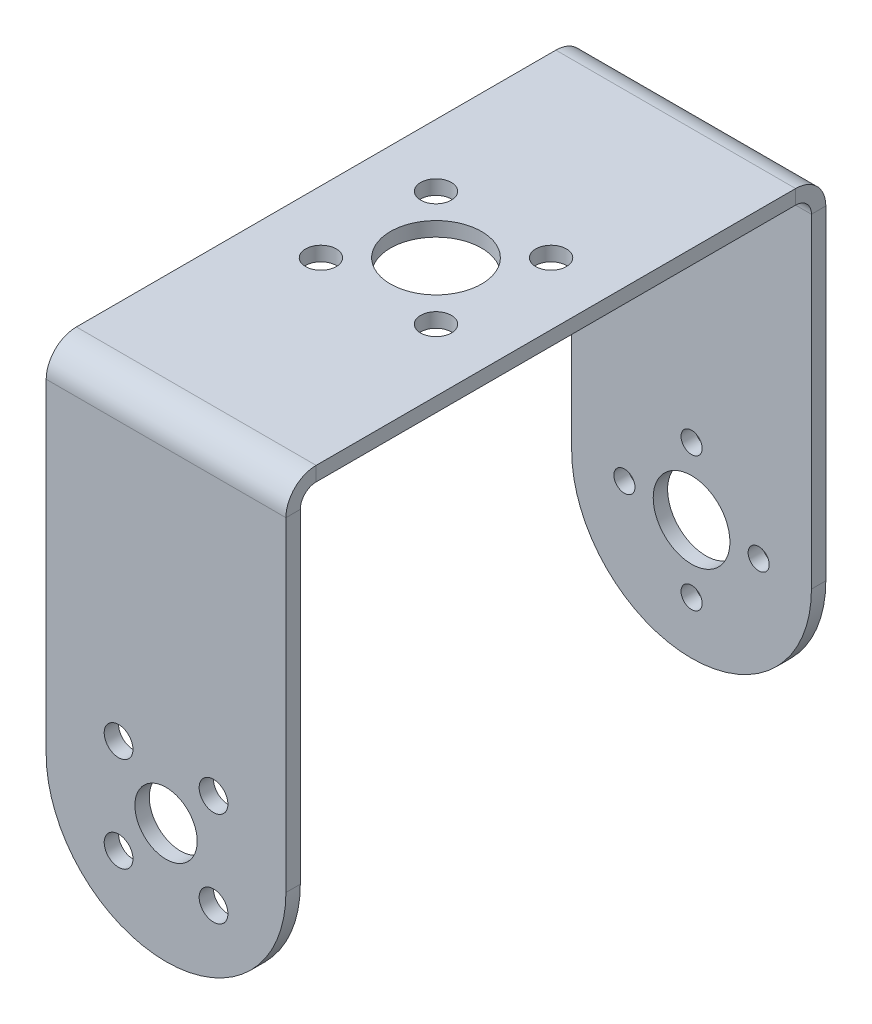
ISO-10303-21;
HEADER;
FILE_DESCRIPTION(('STEP AP214'),'2;1');
FILE_NAME('part.step','',(''),(''),'','','');
FILE_SCHEMA(('AUTOMOTIVE_DESIGN { 1 0 10303 214 1 1 1 1 }'));
ENDSEC;
DATA;
#1=APPLICATION_CONTEXT('core data for automotive mechanical design processes');
#2=APPLICATION_PROTOCOL_DEFINITION('international standard','automotive_design',2000,#1);
#3=PRODUCT_CONTEXT('',#1,'mechanical');
#4=PRODUCT('Part','Part','',(#3));
#5=PRODUCT_RELATED_PRODUCT_CATEGORY('part','',(#4));
#6=PRODUCT_DEFINITION_FORMATION('','',#4);
#7=PRODUCT_DEFINITION_CONTEXT('part definition',#1,'design');
#8=PRODUCT_DEFINITION('design','',#6,#7);
#9=PRODUCT_DEFINITION_SHAPE('','',#8);
#10=(LENGTH_UNIT() NAMED_UNIT(*) SI_UNIT(.MILLI.,.METRE.));
#11=(NAMED_UNIT(*) PLANE_ANGLE_UNIT() SI_UNIT($,.RADIAN.));
#12=(NAMED_UNIT(*) SI_UNIT($,.STERADIAN.) SOLID_ANGLE_UNIT());
#13=UNCERTAINTY_MEASURE_WITH_UNIT(LENGTH_MEASURE(1.E-05),#10,'distance_accuracy_value','');
#14=(GEOMETRIC_REPRESENTATION_CONTEXT(3) GLOBAL_UNCERTAINTY_ASSIGNED_CONTEXT((#13)) GLOBAL_UNIT_ASSIGNED_CONTEXT((#10,
#11,#12)) REPRESENTATION_CONTEXT('',''));
#15=CARTESIAN_POINT('',(0.,0.,0.));
#16=DIRECTION('',(0.,0.,1.));
#17=DIRECTION('',(1.,0.,0.));
#18=AXIS2_PLACEMENT_3D('',#15,#16,#17);
#19=CARTESIAN_POINT('',(0.,-1.5,0.));
#20=DIRECTION('',(0.,1.,0.));
#21=DIRECTION('',(0.,0.,1.));
#22=AXIS2_PLACEMENT_3D('',#19,#20,#21);
#23=PLANE('',#22);
#24=CARTESIAN_POINT('',(0.,-1.5,0.));
#25=DIRECTION('',(0.,1.,0.));
#26=DIRECTION('',(0.,0.,1.));
#27=AXIS2_PLACEMENT_3D('',#24,#25,#26);
#28=CIRCLE('',#27,4.75);
#29=CARTESIAN_POINT('',(0.,-1.5,4.75));
#30=VERTEX_POINT('',#29);
#31=EDGE_CURVE('E1001',#30,#30,#28,.T.);
#32=ORIENTED_EDGE('',*,*,#31,.T.);
#33=EDGE_LOOP('',(#32));
#34=FACE_BOUND('',#33,.T.);
#35=CARTESIAN_POINT('',(-6.,-1.5,6.));
#36=DIRECTION('',(0.,1.,0.));
#37=DIRECTION('',(0.,0.,1.));
#38=AXIS2_PLACEMENT_3D('',#35,#36,#37);
#39=CIRCLE('',#38,1.6);
#40=CARTESIAN_POINT('',(-6.,-1.5,7.6));
#41=VERTEX_POINT('',#40);
#42=EDGE_CURVE('E337',#41,#41,#39,.T.);
#43=ORIENTED_EDGE('',*,*,#42,.T.);
#44=EDGE_LOOP('',(#43));
#45=FACE_BOUND('',#44,.T.);
#46=CARTESIAN_POINT('',(6.,-1.5,6.));
#47=DIRECTION('',(0.,1.,0.));
#48=DIRECTION('',(0.,0.,1.));
#49=AXIS2_PLACEMENT_3D('',#46,#47,#48);
#50=CIRCLE('',#49,1.6);
#51=CARTESIAN_POINT('',(6.,-1.5,7.6));
#52=VERTEX_POINT('',#51);
#53=EDGE_CURVE('E344',#52,#52,#50,.T.);
#54=ORIENTED_EDGE('',*,*,#53,.T.);
#55=EDGE_LOOP('',(#54));
#56=FACE_BOUND('',#55,.T.);
#57=CARTESIAN_POINT('',(6.,-1.5,-6.));
#58=DIRECTION('',(0.,1.,0.));
#59=DIRECTION('',(0.,0.,1.));
#60=AXIS2_PLACEMENT_3D('',#57,#58,#59);
#61=CIRCLE('',#60,1.6);
#62=CARTESIAN_POINT('',(6.,-1.5,-4.4));
#63=VERTEX_POINT('',#62);
#64=EDGE_CURVE('E352',#63,#63,#61,.T.);
#65=ORIENTED_EDGE('',*,*,#64,.T.);
#66=EDGE_LOOP('',(#65));
#67=FACE_BOUND('',#66,.T.);
#68=CARTESIAN_POINT('',(-6.,-1.5,-6.));
#69=DIRECTION('',(0.,1.,0.));
#70=DIRECTION('',(0.,0.,1.));
#71=AXIS2_PLACEMENT_3D('',#68,#69,#70);
#72=CIRCLE('',#71,1.6);
#73=CARTESIAN_POINT('',(-6.,-1.5,-4.4));
#74=VERTEX_POINT('',#73);
#75=EDGE_CURVE('E1025',#74,#74,#72,.T.);
#76=ORIENTED_EDGE('',*,*,#75,.T.);
#77=EDGE_LOOP('',(#76));
#78=FACE_BOUND('',#77,.T.);
#79=DIRECTION('',(1.,0.,0.));
#80=VECTOR('',#79,1.);
#81=CARTESIAN_POINT('',(12.5,-1.50000000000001,-25.));
#82=LINE('',#81,#80);
#83=CARTESIAN_POINT('',(12.5,-1.50000000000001,-25.));
#84=VERTEX_POINT('',#83);
#85=CARTESIAN_POINT('',(-12.5,-1.50000000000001,-25.));
#86=VERTEX_POINT('',#85);
#87=EDGE_CURVE('E203',#84,#86,#82,.F.);
#88=ORIENTED_EDGE('',*,*,#87,.F.);
#89=DIRECTION('',(0.,0.,-1.));
#90=VECTOR('',#89,1.);
#91=CARTESIAN_POINT('',(12.5,-1.5,26.65));
#92=LINE('',#91,#90);
#93=CARTESIAN_POINT('',(12.5,-1.5,25.));
#94=VERTEX_POINT('',#93);
#95=EDGE_CURVE('E279',#94,#84,#92,.T.);
#96=ORIENTED_EDGE('',*,*,#95,.F.);
#97=DIRECTION('',(-1.,0.,0.));
#98=VECTOR('',#97,1.);
#99=CARTESIAN_POINT('',(-12.5,-1.5,25.));
#100=LINE('',#99,#98);
#101=CARTESIAN_POINT('',(-12.5,-1.5,25.));
#102=VERTEX_POINT('',#101);
#103=EDGE_CURVE('E261',#102,#94,#100,.F.);
#104=ORIENTED_EDGE('',*,*,#103,.F.);
#105=DIRECTION('',(0.,0.,1.));
#106=VECTOR('',#105,1.);
#107=CARTESIAN_POINT('',(-12.5,-1.5,26.65));
#108=LINE('',#107,#106);
#109=EDGE_CURVE('E275',#86,#102,#108,.T.);
#110=ORIENTED_EDGE('',*,*,#109,.F.);
#111=EDGE_LOOP('',(#88,#96,#104,#110));
#112=FACE_BOUND('',#111,.T.);
#113=ADVANCED_FACE('F46',(#34,#45,#56,#67,#78,#112),#23,.F.);
#114=CARTESIAN_POINT('',(0.,0.,0.));
#115=DIRECTION('',(0.,1.,0.));
#116=DIRECTION('',(0.,0.,1.));
#117=AXIS2_PLACEMENT_3D('',#114,#115,#116);
#118=PLANE('',#117);
#119=CARTESIAN_POINT('',(0.,0.,0.));
#120=DIRECTION('',(0.,1.,0.));
#121=DIRECTION('',(0.,0.,1.));
#122=AXIS2_PLACEMENT_3D('',#119,#120,#121);
#123=CIRCLE('',#122,4.75);
#124=CARTESIAN_POINT('',(0.,0.,4.75));
#125=VERTEX_POINT('',#124);
#126=EDGE_CURVE('E999',#125,#125,#123,.T.);
#127=ORIENTED_EDGE('',*,*,#126,.F.);
#128=EDGE_LOOP('',(#127));
#129=FACE_BOUND('',#128,.T.);
#130=CARTESIAN_POINT('',(-6.,0.,6.));
#131=DIRECTION('',(0.,1.,0.));
#132=DIRECTION('',(0.,0.,1.));
#133=AXIS2_PLACEMENT_3D('',#130,#131,#132);
#134=CIRCLE('',#133,1.6);
#135=CARTESIAN_POINT('',(-6.,0.,7.6));
#136=VERTEX_POINT('',#135);
#137=EDGE_CURVE('E1003',#136,#136,#134,.T.);
#138=ORIENTED_EDGE('',*,*,#137,.F.);
#139=EDGE_LOOP('',(#138));
#140=FACE_BOUND('',#139,.T.);
#141=CARTESIAN_POINT('',(6.,0.,6.));
#142=DIRECTION('',(0.,1.,0.));
#143=DIRECTION('',(0.,0.,1.));
#144=AXIS2_PLACEMENT_3D('',#141,#142,#143);
#145=CIRCLE('',#144,1.6);
#146=CARTESIAN_POINT('',(6.,0.,7.6));
#147=VERTEX_POINT('',#146);
#148=EDGE_CURVE('E1010',#147,#147,#145,.T.);
#149=ORIENTED_EDGE('',*,*,#148,.F.);
#150=EDGE_LOOP('',(#149));
#151=FACE_BOUND('',#150,.T.);
#152=CARTESIAN_POINT('',(6.,0.,-6.));
#153=DIRECTION('',(0.,1.,0.));
#154=DIRECTION('',(0.,0.,1.));
#155=AXIS2_PLACEMENT_3D('',#152,#153,#154);
#156=CIRCLE('',#155,1.6);
#157=CARTESIAN_POINT('',(6.,0.,-4.4));
#158=VERTEX_POINT('',#157);
#159=EDGE_CURVE('E1014',#158,#158,#156,.T.);
#160=ORIENTED_EDGE('',*,*,#159,.F.);
#161=EDGE_LOOP('',(#160));
#162=FACE_BOUND('',#161,.T.);
#163=CARTESIAN_POINT('',(-6.,0.,-6.));
#164=DIRECTION('',(0.,1.,0.));
#165=DIRECTION('',(0.,0.,1.));
#166=AXIS2_PLACEMENT_3D('',#163,#164,#165);
#167=CIRCLE('',#166,1.6);
#168=CARTESIAN_POINT('',(-6.,0.,-4.4));
#169=VERTEX_POINT('',#168);
#170=EDGE_CURVE('E1018',#169,#169,#167,.T.);
#171=ORIENTED_EDGE('',*,*,#170,.F.);
#172=EDGE_LOOP('',(#171));
#173=FACE_BOUND('',#172,.T.);
#174=DIRECTION('',(0.,0.,-1.));
#175=VECTOR('',#174,1.);
#176=CARTESIAN_POINT('',(12.5,0.,26.65));
#177=LINE('',#176,#175);
#178=CARTESIAN_POINT('',(12.5,0.,25.));
#179=VERTEX_POINT('',#178);
#180=CARTESIAN_POINT('',(12.5,0.,-25.));
#181=VERTEX_POINT('',#180);
#182=EDGE_CURVE('E280',#179,#181,#177,.T.);
#183=ORIENTED_EDGE('',*,*,#182,.T.);
#184=DIRECTION('',(1.,0.,0.));
#185=VECTOR('',#184,1.);
#186=CARTESIAN_POINT('',(12.5,0.,-25.));
#187=LINE('',#186,#185);
#188=CARTESIAN_POINT('',(-12.5,0.,-25.));
#189=VERTEX_POINT('',#188);
#190=EDGE_CURVE('E157',#181,#189,#187,.F.);
#191=ORIENTED_EDGE('',*,*,#190,.T.);
#192=DIRECTION('',(0.,0.,1.));
#193=VECTOR('',#192,1.);
#194=CARTESIAN_POINT('',(-12.5,0.,26.65));
#195=LINE('',#194,#193);
#196=CARTESIAN_POINT('',(-12.5,0.,25.));
#197=VERTEX_POINT('',#196);
#198=EDGE_CURVE('E271',#189,#197,#195,.T.);
#199=ORIENTED_EDGE('',*,*,#198,.T.);
#200=DIRECTION('',(-1.,0.,0.));
#201=VECTOR('',#200,1.);
#202=CARTESIAN_POINT('',(-12.5,0.,25.));
#203=LINE('',#202,#201);
#204=EDGE_CURVE('E244',#197,#179,#203,.F.);
#205=ORIENTED_EDGE('',*,*,#204,.T.);
#206=EDGE_LOOP('',(#183,#191,#199,#205));
#207=FACE_BOUND('',#206,.T.);
#208=ADVANCED_FACE('F467',(#129,#140,#151,#162,#173,#207),#118,.T.);
#209=CARTESIAN_POINT('',(12.5,-1.5,26.65));
#210=DIRECTION('',(1.,0.,0.));
#211=DIRECTION('',(0.,0.,-1.));
#212=AXIS2_PLACEMENT_3D('',#209,#210,#211);
#213=PLANE('',#212);
#214=ORIENTED_EDGE('',*,*,#95,.T.);
#215=DIRECTION('',(0.,1.,0.));
#216=VECTOR('',#215,1.);
#217=CARTESIAN_POINT('',(12.5,-1.50000000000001,-25.));
#218=LINE('',#217,#216);
#219=EDGE_CURVE('E198',#84,#181,#218,.T.);
#220=ORIENTED_EDGE('',*,*,#219,.T.);
#221=ORIENTED_EDGE('',*,*,#182,.F.);
#222=DIRECTION('',(0.,1.,0.));
#223=VECTOR('',#222,1.);
#224=CARTESIAN_POINT('',(12.5,-1.5,25.));
#225=LINE('',#224,#223);
#226=EDGE_CURVE('E267',#94,#179,#225,.T.);
#227=ORIENTED_EDGE('',*,*,#226,.F.);
#228=EDGE_LOOP('',(#214,#220,#221,#227));
#229=FACE_BOUND('',#228,.T.);
#230=ADVANCED_FACE('F473',(#229),#213,.T.);
#231=CARTESIAN_POINT('',(-12.5,-1.5,26.65));
#232=DIRECTION('',(-1.,0.,0.));
#233=DIRECTION('',(0.,0.,1.));
#234=AXIS2_PLACEMENT_3D('',#231,#232,#233);
#235=PLANE('',#234);
#236=DIRECTION('',(0.,1.,0.));
#237=VECTOR('',#236,1.);
#238=CARTESIAN_POINT('',(-12.5,-1.50000000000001,-25.));
#239=LINE('',#238,#237);
#240=EDGE_CURVE('E208',#86,#189,#239,.T.);
#241=ORIENTED_EDGE('',*,*,#240,.F.);
#242=ORIENTED_EDGE('',*,*,#109,.T.);
#243=DIRECTION('',(0.,1.,0.));
#244=VECTOR('',#243,1.);
#245=CARTESIAN_POINT('',(-12.5,-1.5,25.));
#246=LINE('',#245,#244);
#247=EDGE_CURVE('E253',#102,#197,#246,.T.);
#248=ORIENTED_EDGE('',*,*,#247,.T.);
#249=ORIENTED_EDGE('',*,*,#198,.F.);
#250=EDGE_LOOP('',(#241,#242,#248,#249));
#251=FACE_BOUND('',#250,.T.);
#252=ADVANCED_FACE('F483',(#251),#235,.T.);
#253=CARTESIAN_POINT('',(12.5,-3.15,25.));
#254=DIRECTION('',(1.,0.,0.));
#255=DIRECTION('',(0.,0.,-1.));
#256=AXIS2_PLACEMENT_3D('',#253,#254,#255);
#257=PLANE('',#256);
#258=DIRECTION('',(0.,0.,1.));
#259=VECTOR('',#258,1.);
#260=CARTESIAN_POINT('',(12.5,-3.15,26.65));
#261=LINE('',#260,#259);
#262=CARTESIAN_POINT('',(12.5,-3.14999999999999,26.65));
#263=VERTEX_POINT('',#262);
#264=CARTESIAN_POINT('',(12.5,-3.14999999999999,28.15));
#265=VERTEX_POINT('',#264);
#266=EDGE_CURVE('E212',#263,#265,#261,.T.);
#267=ORIENTED_EDGE('',*,*,#266,.F.);
#268=CARTESIAN_POINT('',(12.5,-3.15,25.));
#269=DIRECTION('',(-1.,0.,0.));
#270=DIRECTION('',(0.,0.,1.));
#271=AXIS2_PLACEMENT_3D('',#268,#269,#270);
#272=CIRCLE('',#271,1.65);
#273=EDGE_CURVE('E257',#94,#263,#272,.F.);
#274=ORIENTED_EDGE('',*,*,#273,.F.);
#275=ORIENTED_EDGE('',*,*,#226,.T.);
#276=CARTESIAN_POINT('',(12.5,-3.15,25.));
#277=DIRECTION('',(-1.,0.,0.));
#278=DIRECTION('',(0.,0.,1.));
#279=AXIS2_PLACEMENT_3D('',#276,#277,#278);
#280=CIRCLE('',#279,3.15);
#281=EDGE_CURVE('E248',#179,#265,#280,.F.);
#282=ORIENTED_EDGE('',*,*,#281,.T.);
#283=EDGE_LOOP('',(#267,#274,#275,#282));
#284=FACE_BOUND('',#283,.T.);
#285=ADVANCED_FACE('F487',(#284),#257,.T.);
#286=CARTESIAN_POINT('',(-12.5,-3.15,25.));
#287=DIRECTION('',(1.,0.,0.));
#288=DIRECTION('',(0.,0.,-1.));
#289=AXIS2_PLACEMENT_3D('',#286,#287,#288);
#290=PLANE('',#289);
#291=CARTESIAN_POINT('',(-12.5,-3.15,25.));
#292=DIRECTION('',(-1.,0.,0.));
#293=DIRECTION('',(0.,0.,1.));
#294=AXIS2_PLACEMENT_3D('',#291,#292,#293);
#295=CIRCLE('',#294,1.65);
#296=CARTESIAN_POINT('',(-12.5,-3.14999999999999,26.65));
#297=VERTEX_POINT('',#296);
#298=EDGE_CURVE('E238',#297,#102,#295,.T.);
#299=ORIENTED_EDGE('',*,*,#298,.F.);
#300=DIRECTION('',(0.,0.,1.));
#301=VECTOR('',#300,1.);
#302=CARTESIAN_POINT('',(-12.5,-3.15,26.65));
#303=LINE('',#302,#301);
#304=CARTESIAN_POINT('',(-12.5,-3.15,28.15));
#305=VERTEX_POINT('',#304);
#306=EDGE_CURVE('E218',#297,#305,#303,.T.);
#307=ORIENTED_EDGE('',*,*,#306,.T.);
#308=CARTESIAN_POINT('',(-12.5,-3.15,25.));
#309=DIRECTION('',(-1.,0.,0.));
#310=DIRECTION('',(0.,0.,1.));
#311=AXIS2_PLACEMENT_3D('',#308,#309,#310);
#312=CIRCLE('',#311,3.15);
#313=EDGE_CURVE('E249',#305,#197,#312,.T.);
#314=ORIENTED_EDGE('',*,*,#313,.T.);
#315=ORIENTED_EDGE('',*,*,#247,.F.);
#316=EDGE_LOOP('',(#299,#307,#314,#315));
#317=FACE_BOUND('',#316,.T.);
#318=ADVANCED_FACE('F478',(#317),#290,.F.);
#319=CARTESIAN_POINT('',(-12.5,-3.15,25.));
#320=DIRECTION('',(-1.,0.,0.));
#321=DIRECTION('',(0.,0.,1.));
#322=AXIS2_PLACEMENT_3D('',#319,#320,#321);
#323=CYLINDRICAL_SURFACE('',#322,3.15);
#324=ORIENTED_EDGE('',*,*,#204,.F.);
#325=ORIENTED_EDGE('',*,*,#313,.F.);
#326=DIRECTION('',(1.,0.,0.));
#327=VECTOR('',#326,1.);
#328=CARTESIAN_POINT('',(0.,-3.15,28.15));
#329=LINE('',#328,#327);
#330=EDGE_CURVE('E222',#305,#265,#329,.T.);
#331=ORIENTED_EDGE('',*,*,#330,.T.);
#332=ORIENTED_EDGE('',*,*,#281,.F.);
#333=EDGE_LOOP('',(#324,#325,#331,#332));
#334=FACE_BOUND('',#333,.T.);
#335=ADVANCED_FACE('F529',(#334),#323,.T.);
#336=CARTESIAN_POINT('',(-12.5,-3.15,25.));
#337=DIRECTION('',(-1.,0.,0.));
#338=DIRECTION('',(0.,0.,1.));
#339=AXIS2_PLACEMENT_3D('',#336,#337,#338);
#340=CYLINDRICAL_SURFACE('',#339,1.65);
#341=ORIENTED_EDGE('',*,*,#103,.T.);
#342=ORIENTED_EDGE('',*,*,#273,.T.);
#343=DIRECTION('',(-1.,0.,0.));
#344=VECTOR('',#343,1.);
#345=CARTESIAN_POINT('',(12.5,-3.15,26.65));
#346=LINE('',#345,#344);
#347=EDGE_CURVE('E215',#263,#297,#346,.T.);
#348=ORIENTED_EDGE('',*,*,#347,.T.);
#349=ORIENTED_EDGE('',*,*,#298,.T.);
#350=EDGE_LOOP('',(#341,#342,#348,#349));
#351=FACE_BOUND('',#350,.T.);
#352=ADVANCED_FACE('F517',(#351),#340,.F.);
#353=CARTESIAN_POINT('',(-12.5,-49.5,28.1500000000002));
#354=DIRECTION('',(1.,0.,0.));
#355=DIRECTION('',(0.,1.,0.));
#356=AXIS2_PLACEMENT_3D('',#353,#354,#355);
#357=PLANE('',#356);
#358=DIRECTION('',(0.,-1.,0.));
#359=VECTOR('',#358,1.);
#360=CARTESIAN_POINT('',(-12.5,-49.5,26.6500000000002));
#361=LINE('',#360,#359);
#362=CARTESIAN_POINT('',(-12.5,-37.,26.6500000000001));
#363=VERTEX_POINT('',#362);
#364=EDGE_CURVE('E229',#297,#363,#361,.T.);
#365=ORIENTED_EDGE('',*,*,#364,.T.);
#366=DIRECTION('',(0.,0.,-1.));
#367=VECTOR('',#366,1.);
#368=CARTESIAN_POINT('',(-12.5,-37.,28.1500000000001));
#369=LINE('',#368,#367);
#370=CARTESIAN_POINT('',(-12.5,-37.,28.1500000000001));
#371=VERTEX_POINT('',#370);
#372=EDGE_CURVE('E306',#363,#371,#369,.F.);
#373=ORIENTED_EDGE('',*,*,#372,.T.);
#374=DIRECTION('',(0.,-1.,0.));
#375=VECTOR('',#374,1.);
#376=CARTESIAN_POINT('',(-12.5,-49.5,28.1500000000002));
#377=LINE('',#376,#375);
#378=EDGE_CURVE('E230',#305,#371,#377,.T.);
#379=ORIENTED_EDGE('',*,*,#378,.F.);
#380=ORIENTED_EDGE('',*,*,#306,.F.);
#381=EDGE_LOOP('',(#365,#373,#379,#380));
#382=FACE_BOUND('',#381,.T.);
#383=ADVANCED_FACE('F525',(#382),#357,.F.);
#384=CARTESIAN_POINT('',(12.5,-1.49999999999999,28.15));
#385=DIRECTION('',(-1.,0.,0.));
#386=DIRECTION('',(0.,0.,1.));
#387=AXIS2_PLACEMENT_3D('',#384,#385,#386);
#388=PLANE('',#387);
#389=DIRECTION('',(0.,1.,0.));
#390=VECTOR('',#389,1.);
#391=CARTESIAN_POINT('',(12.5,-1.49999999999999,28.15));
#392=LINE('',#391,#390);
#393=CARTESIAN_POINT('',(12.5,-37.,28.1500000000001));
#394=VERTEX_POINT('',#393);
#395=EDGE_CURVE('E234',#394,#265,#392,.T.);
#396=ORIENTED_EDGE('',*,*,#395,.F.);
#397=DIRECTION('',(0.,0.,-1.));
#398=VECTOR('',#397,1.);
#399=CARTESIAN_POINT('',(12.5,-37.,28.1500000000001));
#400=LINE('',#399,#398);
#401=CARTESIAN_POINT('',(12.5,-37.,26.6500000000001));
#402=VERTEX_POINT('',#401);
#403=EDGE_CURVE('E284',#394,#402,#400,.T.);
#404=ORIENTED_EDGE('',*,*,#403,.T.);
#405=DIRECTION('',(0.,1.,0.));
#406=VECTOR('',#405,1.);
#407=CARTESIAN_POINT('',(12.5,-1.5,26.65));
#408=LINE('',#407,#406);
#409=EDGE_CURVE('E235',#402,#263,#408,.T.);
#410=ORIENTED_EDGE('',*,*,#409,.T.);
#411=ORIENTED_EDGE('',*,*,#266,.T.);
#412=EDGE_LOOP('',(#396,#404,#410,#411));
#413=FACE_BOUND('',#412,.T.);
#414=ADVANCED_FACE('F509',(#413),#388,.F.);
#415=CARTESIAN_POINT('',(0.,0.,28.15));
#416=DIRECTION('',(0.,0.,-1.));
#417=DIRECTION('',(0.,1.,0.));
#418=AXIS2_PLACEMENT_3D('',#415,#416,#417);
#419=PLANE('',#418);
#420=CARTESIAN_POINT('',(4.94974746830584,-32.0502525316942,28.15));
#421=DIRECTION('',(0.,0.,1.));
#422=DIRECTION('',(1.,0.,0.));
#423=AXIS2_PLACEMENT_3D('',#420,#421,#422);
#424=CIRCLE('',#423,1.5);
#425=CARTESIAN_POINT('',(6.44974746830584,-32.0502525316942,28.15));
#426=VERTEX_POINT('',#425);
#427=EDGE_CURVE('E408',#426,#426,#424,.T.);
#428=ORIENTED_EDGE('',*,*,#427,.F.);
#429=EDGE_LOOP('',(#428));
#430=FACE_BOUND('',#429,.T.);
#431=CARTESIAN_POINT('',(-4.94974746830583,-41.9497474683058,28.15));
#432=DIRECTION('',(0.,0.,1.));
#433=DIRECTION('',(1.,0.,0.));
#434=AXIS2_PLACEMENT_3D('',#431,#432,#433);
#435=CIRCLE('',#434,1.5);
#436=CARTESIAN_POINT('',(-3.44974746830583,-41.9497474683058,28.15));
#437=VERTEX_POINT('',#436);
#438=EDGE_CURVE('E401',#437,#437,#435,.T.);
#439=ORIENTED_EDGE('',*,*,#438,.F.);
#440=EDGE_LOOP('',(#439));
#441=FACE_BOUND('',#440,.T.);
#442=CARTESIAN_POINT('',(4.94974746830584,-41.9497474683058,28.15));
#443=DIRECTION('',(0.,0.,1.));
#444=DIRECTION('',(1.,0.,0.));
#445=AXIS2_PLACEMENT_3D('',#442,#443,#444);
#446=CIRCLE('',#445,1.5);
#447=CARTESIAN_POINT('',(6.44974746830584,-41.9497474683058,28.15));
#448=VERTEX_POINT('',#447);
#449=EDGE_CURVE('E392',#448,#448,#446,.T.);
#450=ORIENTED_EDGE('',*,*,#449,.F.);
#451=EDGE_LOOP('',(#450));
#452=FACE_BOUND('',#451,.T.);
#453=CARTESIAN_POINT('',(0.,-37.,28.15));
#454=DIRECTION('',(0.,0.,1.));
#455=DIRECTION('',(1.,0.,0.));
#456=AXIS2_PLACEMENT_3D('',#453,#454,#455);
#457=CIRCLE('',#456,3.25);
#458=CARTESIAN_POINT('',(3.25000000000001,-37.,28.15));
#459=VERTEX_POINT('',#458);
#460=EDGE_CURVE('E388',#459,#459,#457,.T.);
#461=ORIENTED_EDGE('',*,*,#460,.F.);
#462=EDGE_LOOP('',(#461));
#463=FACE_BOUND('',#462,.T.);
#464=CARTESIAN_POINT('',(-4.94974746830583,-32.0502525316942,28.15));
#465=DIRECTION('',(0.,0.,1.));
#466=DIRECTION('',(1.,0.,0.));
#467=AXIS2_PLACEMENT_3D('',#464,#465,#466);
#468=CIRCLE('',#467,1.5);
#469=CARTESIAN_POINT('',(-3.44974746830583,-32.0502525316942,28.15));
#470=VERTEX_POINT('',#469);
#471=EDGE_CURVE('E427',#470,#470,#468,.T.);
#472=ORIENTED_EDGE('',*,*,#471,.F.);
#473=EDGE_LOOP('',(#472));
#474=FACE_BOUND('',#473,.T.);
#475=CARTESIAN_POINT('',(0.,-37.,28.1500000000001));
#476=DIRECTION('',(0.,0.,-1.));
#477=DIRECTION('',(0.,1.,0.));
#478=AXIS2_PLACEMENT_3D('',#475,#476,#477);
#479=CIRCLE('',#478,12.5);
#480=CARTESIAN_POINT('',(0.,-49.5,28.1500000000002));
#481=VERTEX_POINT('',#480);
#482=EDGE_CURVE('E300',#371,#481,#479,.F.);
#483=ORIENTED_EDGE('',*,*,#482,.T.);
#484=CARTESIAN_POINT('',(0.,-37.,28.1500000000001));
#485=DIRECTION('',(0.,0.,-1.));
#486=DIRECTION('',(0.,1.,0.));
#487=AXIS2_PLACEMENT_3D('',#484,#485,#486);
#488=CIRCLE('',#487,12.5);
#489=EDGE_CURVE('E303',#481,#394,#488,.F.);
#490=ORIENTED_EDGE('',*,*,#489,.T.);
#491=ORIENTED_EDGE('',*,*,#395,.T.);
#492=ORIENTED_EDGE('',*,*,#330,.F.);
#493=ORIENTED_EDGE('',*,*,#378,.T.);
#494=EDGE_LOOP('',(#483,#490,#491,#492,#493));
#495=FACE_BOUND('',#494,.T.);
#496=ADVANCED_FACE('F506',(#430,#441,#452,#463,#474,#495),#419,.F.);
#497=CARTESIAN_POINT('',(0.,0.,26.65));
#498=DIRECTION('',(0.,0.,-1.));
#499=DIRECTION('',(0.,1.,0.));
#500=AXIS2_PLACEMENT_3D('',#497,#498,#499);
#501=PLANE('',#500);
#502=CARTESIAN_POINT('',(4.94974746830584,-32.0502525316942,26.6500000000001));
#503=DIRECTION('',(0.,0.,-1.));
#504=DIRECTION('',(0.,1.,0.));
#505=AXIS2_PLACEMENT_3D('',#502,#503,#504);
#506=CIRCLE('',#505,1.5);
#507=CARTESIAN_POINT('',(4.94974746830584,-30.5502525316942,26.6500000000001));
#508=VERTEX_POINT('',#507);
#509=EDGE_CURVE('E412',#508,#508,#506,.F.);
#510=ORIENTED_EDGE('',*,*,#509,.T.);
#511=EDGE_LOOP('',(#510));
#512=FACE_BOUND('',#511,.T.);
#513=CARTESIAN_POINT('',(-4.94974746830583,-41.9497474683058,26.6500000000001));
#514=DIRECTION('',(0.,0.,-1.));
#515=DIRECTION('',(0.,1.,0.));
#516=AXIS2_PLACEMENT_3D('',#513,#514,#515);
#517=CIRCLE('',#516,1.5);
#518=CARTESIAN_POINT('',(-4.94974746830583,-40.4497474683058,26.6500000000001));
#519=VERTEX_POINT('',#518);
#520=EDGE_CURVE('E413',#519,#519,#517,.F.);
#521=ORIENTED_EDGE('',*,*,#520,.T.);
#522=EDGE_LOOP('',(#521));
#523=FACE_BOUND('',#522,.T.);
#524=CARTESIAN_POINT('',(4.94974746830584,-41.9497474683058,26.6500000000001));
#525=DIRECTION('',(0.,0.,-1.));
#526=DIRECTION('',(0.,1.,0.));
#527=AXIS2_PLACEMENT_3D('',#524,#525,#526);
#528=CIRCLE('',#527,1.5);
#529=CARTESIAN_POINT('',(4.94974746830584,-40.4497474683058,26.6500000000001));
#530=VERTEX_POINT('',#529);
#531=EDGE_CURVE('E396',#530,#530,#528,.F.);
#532=ORIENTED_EDGE('',*,*,#531,.T.);
#533=EDGE_LOOP('',(#532));
#534=FACE_BOUND('',#533,.T.);
#535=CARTESIAN_POINT('',(0.,-37.,26.6500000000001));
#536=DIRECTION('',(0.,0.,-1.));
#537=DIRECTION('',(0.,1.,0.));
#538=AXIS2_PLACEMENT_3D('',#535,#536,#537);
#539=CIRCLE('',#538,3.25);
#540=CARTESIAN_POINT('',(0.,-33.75,26.6500000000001));
#541=VERTEX_POINT('',#540);
#542=EDGE_CURVE('E397',#541,#541,#539,.F.);
#543=ORIENTED_EDGE('',*,*,#542,.T.);
#544=EDGE_LOOP('',(#543));
#545=FACE_BOUND('',#544,.T.);
#546=CARTESIAN_POINT('',(-4.94974746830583,-32.0502525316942,26.6500000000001));
#547=DIRECTION('',(0.,0.,-1.));
#548=DIRECTION('',(0.,1.,0.));
#549=AXIS2_PLACEMENT_3D('',#546,#547,#548);
#550=CIRCLE('',#549,1.5);
#551=CARTESIAN_POINT('',(-4.94974746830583,-30.5502525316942,26.6500000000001));
#552=VERTEX_POINT('',#551);
#553=EDGE_CURVE('E417',#552,#552,#550,.F.);
#554=ORIENTED_EDGE('',*,*,#553,.T.);
#555=EDGE_LOOP('',(#554));
#556=FACE_BOUND('',#555,.T.);
#557=ORIENTED_EDGE('',*,*,#409,.F.);
#558=CARTESIAN_POINT('',(0.,-37.,26.6500000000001));
#559=DIRECTION('',(0.,0.,-1.));
#560=DIRECTION('',(0.,1.,0.));
#561=AXIS2_PLACEMENT_3D('',#558,#559,#560);
#562=CIRCLE('',#561,12.5);
#563=CARTESIAN_POINT('',(0.,-49.5,26.6500000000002));
#564=VERTEX_POINT('',#563);
#565=EDGE_CURVE('E297',#402,#564,#562,.T.);
#566=ORIENTED_EDGE('',*,*,#565,.T.);
#567=CARTESIAN_POINT('',(0.,-37.,26.6500000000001));
#568=DIRECTION('',(0.,0.,-1.));
#569=DIRECTION('',(0.,1.,0.));
#570=AXIS2_PLACEMENT_3D('',#567,#568,#569);
#571=CIRCLE('',#570,12.5);
#572=EDGE_CURVE('E294',#564,#363,#571,.T.);
#573=ORIENTED_EDGE('',*,*,#572,.T.);
#574=ORIENTED_EDGE('',*,*,#364,.F.);
#575=ORIENTED_EDGE('',*,*,#347,.F.);
#576=EDGE_LOOP('',(#557,#566,#573,#574,#575));
#577=FACE_BOUND('',#576,.T.);
#578=ADVANCED_FACE('F522',(#512,#523,#534,#545,#556,#577),#501,.T.);
#579=CARTESIAN_POINT('',(-12.5,-3.15000000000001,-25.));
#580=DIRECTION('',(-1.,0.,0.));
#581=DIRECTION('',(0.,0.,1.));
#582=AXIS2_PLACEMENT_3D('',#579,#580,#581);
#583=PLANE('',#582);
#584=DIRECTION('',(0.,0.,-1.));
#585=VECTOR('',#584,1.);
#586=CARTESIAN_POINT('',(-12.5,-3.15,-26.65));
#587=LINE('',#586,#585);
#588=CARTESIAN_POINT('',(-12.5,-3.15,-26.65));
#589=VERTEX_POINT('',#588);
#590=CARTESIAN_POINT('',(-12.5,-3.15,-28.15));
#591=VERTEX_POINT('',#590);
#592=EDGE_CURVE('E431',#589,#591,#587,.T.);
#593=ORIENTED_EDGE('',*,*,#592,.F.);
#594=CARTESIAN_POINT('',(-12.5,-3.15000000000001,-25.));
#595=DIRECTION('',(1.,0.,0.));
#596=DIRECTION('',(0.,0.,-1.));
#597=AXIS2_PLACEMENT_3D('',#594,#595,#596);
#598=CIRCLE('',#597,1.65);
#599=EDGE_CURVE('E161',#86,#589,#598,.F.);
#600=ORIENTED_EDGE('',*,*,#599,.F.);
#601=ORIENTED_EDGE('',*,*,#240,.T.);
#602=CARTESIAN_POINT('',(-12.5,-3.15000000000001,-25.));
#603=DIRECTION('',(1.,0.,0.));
#604=DIRECTION('',(0.,0.,-1.));
#605=AXIS2_PLACEMENT_3D('',#602,#603,#604);
#606=CIRCLE('',#605,3.15);
#607=EDGE_CURVE('E196',#189,#591,#606,.F.);
#608=ORIENTED_EDGE('',*,*,#607,.T.);
#609=EDGE_LOOP('',(#593,#600,#601,#608));
#610=FACE_BOUND('',#609,.T.);
#611=ADVANCED_FACE('F444',(#610),#583,.T.);
#612=CARTESIAN_POINT('',(12.5,-3.15000000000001,-25.));
#613=DIRECTION('',(-1.,0.,0.));
#614=DIRECTION('',(0.,0.,1.));
#615=AXIS2_PLACEMENT_3D('',#612,#613,#614);
#616=PLANE('',#615);
#617=CARTESIAN_POINT('',(12.5,-3.15000000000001,-25.));
#618=DIRECTION('',(1.,0.,0.));
#619=DIRECTION('',(0.,0.,-1.));
#620=AXIS2_PLACEMENT_3D('',#617,#618,#619);
#621=CIRCLE('',#620,1.65);
#622=CARTESIAN_POINT('',(12.5,-3.15,-26.65));
#623=VERTEX_POINT('',#622);
#624=EDGE_CURVE('E168',#623,#84,#621,.T.);
#625=ORIENTED_EDGE('',*,*,#624,.F.);
#626=DIRECTION('',(0.,0.,-1.));
#627=VECTOR('',#626,1.);
#628=CARTESIAN_POINT('',(12.5,-3.15,-26.65));
#629=LINE('',#628,#627);
#630=CARTESIAN_POINT('',(12.5,-3.14999999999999,-28.15));
#631=VERTEX_POINT('',#630);
#632=EDGE_CURVE('E165',#623,#631,#629,.T.);
#633=ORIENTED_EDGE('',*,*,#632,.T.);
#634=CARTESIAN_POINT('',(12.5,-3.15000000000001,-25.));
#635=DIRECTION('',(1.,0.,0.));
#636=DIRECTION('',(0.,0.,-1.));
#637=AXIS2_PLACEMENT_3D('',#634,#635,#636);
#638=CIRCLE('',#637,3.15);
#639=EDGE_CURVE('E150',#631,#181,#638,.T.);
#640=ORIENTED_EDGE('',*,*,#639,.T.);
#641=ORIENTED_EDGE('',*,*,#219,.F.);
#642=EDGE_LOOP('',(#625,#633,#640,#641));
#643=FACE_BOUND('',#642,.T.);
#644=ADVANCED_FACE('F166',(#643),#616,.F.);
#645=CARTESIAN_POINT('',(12.5,-3.15000000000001,-25.));
#646=DIRECTION('',(1.,0.,0.));
#647=DIRECTION('',(0.,0.,-1.));
#648=AXIS2_PLACEMENT_3D('',#645,#646,#647);
#649=CYLINDRICAL_SURFACE('',#648,3.15);
#650=ORIENTED_EDGE('',*,*,#190,.F.);
#651=ORIENTED_EDGE('',*,*,#639,.F.);
#652=DIRECTION('',(-1.,0.,0.));
#653=VECTOR('',#652,1.);
#654=CARTESIAN_POINT('',(0.,-3.14999999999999,-28.15));
#655=LINE('',#654,#653);
#656=EDGE_CURVE('E154',#631,#591,#655,.T.);
#657=ORIENTED_EDGE('',*,*,#656,.T.);
#658=ORIENTED_EDGE('',*,*,#607,.F.);
#659=EDGE_LOOP('',(#650,#651,#657,#658));
#660=FACE_BOUND('',#659,.T.);
#661=ADVANCED_FACE('F152',(#660),#649,.T.);
#662=CARTESIAN_POINT('',(12.5,-3.15000000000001,-25.));
#663=DIRECTION('',(1.,0.,0.));
#664=DIRECTION('',(0.,0.,-1.));
#665=AXIS2_PLACEMENT_3D('',#662,#663,#664);
#666=CYLINDRICAL_SURFACE('',#665,1.65);
#667=ORIENTED_EDGE('',*,*,#87,.T.);
#668=ORIENTED_EDGE('',*,*,#599,.T.);
#669=DIRECTION('',(1.,0.,0.));
#670=VECTOR('',#669,1.);
#671=CARTESIAN_POINT('',(-12.5,-3.15,-26.65));
#672=LINE('',#671,#670);
#673=EDGE_CURVE('E171',#589,#623,#672,.T.);
#674=ORIENTED_EDGE('',*,*,#673,.T.);
#675=ORIENTED_EDGE('',*,*,#624,.T.);
#676=EDGE_LOOP('',(#667,#668,#674,#675));
#677=FACE_BOUND('',#676,.T.);
#678=ADVANCED_FACE('F448',(#677),#666,.F.);
#679=CARTESIAN_POINT('',(12.5,-49.5,-28.1500000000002));
#680=DIRECTION('',(-1.,0.,0.));
#681=DIRECTION('',(0.,0.,1.));
#682=AXIS2_PLACEMENT_3D('',#679,#680,#681);
#683=PLANE('',#682);
#684=DIRECTION('',(0.,-1.,0.));
#685=VECTOR('',#684,1.);
#686=CARTESIAN_POINT('',(12.5,-49.5,-26.6500000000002));
#687=LINE('',#686,#685);
#688=CARTESIAN_POINT('',(12.5,-37.,-26.6500000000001));
#689=VERTEX_POINT('',#688);
#690=EDGE_CURVE('E178',#623,#689,#687,.T.);
#691=ORIENTED_EDGE('',*,*,#690,.T.);
#692=DIRECTION('',(0.,0.,1.));
#693=VECTOR('',#692,1.);
#694=CARTESIAN_POINT('',(12.5,-37.,-28.1500000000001));
#695=LINE('',#694,#693);
#696=CARTESIAN_POINT('',(12.5,-37.,-28.1500000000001));
#697=VERTEX_POINT('',#696);
#698=EDGE_CURVE('E11',#689,#697,#695,.F.);
#699=ORIENTED_EDGE('',*,*,#698,.T.);
#700=DIRECTION('',(0.,-1.,0.));
#701=VECTOR('',#700,1.);
#702=CARTESIAN_POINT('',(12.5,-49.5,-28.1500000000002));
#703=LINE('',#702,#701);
#704=EDGE_CURVE('E174',#631,#697,#703,.T.);
#705=ORIENTED_EDGE('',*,*,#704,.F.);
#706=ORIENTED_EDGE('',*,*,#632,.F.);
#707=EDGE_LOOP('',(#691,#699,#705,#706));
#708=FACE_BOUND('',#707,.T.);
#709=ADVANCED_FACE('F180',(#708),#683,.F.);
#710=CARTESIAN_POINT('',(-12.5,-1.49999999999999,-28.15));
#711=DIRECTION('',(1.,0.,0.));
#712=DIRECTION('',(0.,0.,-1.));
#713=AXIS2_PLACEMENT_3D('',#710,#711,#712);
#714=PLANE('',#713);
#715=DIRECTION('',(0.,1.,0.));
#716=VECTOR('',#715,1.);
#717=CARTESIAN_POINT('',(-12.5,-1.49999999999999,-28.15));
#718=LINE('',#717,#716);
#719=CARTESIAN_POINT('',(-12.5,-37.,-28.1500000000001));
#720=VERTEX_POINT('',#719);
#721=EDGE_CURVE('E176',#720,#591,#718,.T.);
#722=ORIENTED_EDGE('',*,*,#721,.F.);
#723=DIRECTION('',(0.,0.,1.));
#724=VECTOR('',#723,1.);
#725=CARTESIAN_POINT('',(-12.5,-37.,-28.1500000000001));
#726=LINE('',#725,#724);
#727=CARTESIAN_POINT('',(-12.5,-37.,-26.6500000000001));
#728=VERTEX_POINT('',#727);
#729=EDGE_CURVE('E309',#720,#728,#726,.T.);
#730=ORIENTED_EDGE('',*,*,#729,.T.);
#731=DIRECTION('',(0.,1.,0.));
#732=VECTOR('',#731,1.);
#733=CARTESIAN_POINT('',(-12.5,-1.5,-26.65));
#734=LINE('',#733,#732);
#735=EDGE_CURVE('E182',#728,#589,#734,.T.);
#736=ORIENTED_EDGE('',*,*,#735,.T.);
#737=ORIENTED_EDGE('',*,*,#592,.T.);
#738=EDGE_LOOP('',(#722,#730,#736,#737));
#739=FACE_BOUND('',#738,.T.);
#740=ADVANCED_FACE('F439',(#739),#714,.F.);
#741=CARTESIAN_POINT('',(0.,0.,-28.15));
#742=DIRECTION('',(0.,0.,1.));
#743=DIRECTION('',(0.,-1.,0.));
#744=AXIS2_PLACEMENT_3D('',#741,#742,#743);
#745=PLANE('',#744);
#746=CARTESIAN_POINT('',(0.,-43.9999999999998,-28.1500000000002));
#747=DIRECTION('',(0.,0.,-1.));
#748=DIRECTION('',(0.,1.,0.));
#749=AXIS2_PLACEMENT_3D('',#746,#747,#748);
#750=CIRCLE('',#749,1.1);
#751=CARTESIAN_POINT('',(0.,-42.8999999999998,-28.1500000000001));
#752=VERTEX_POINT('',#751);
#753=EDGE_CURVE('E373',#752,#752,#750,.T.);
#754=ORIENTED_EDGE('',*,*,#753,.F.);
#755=EDGE_LOOP('',(#754));
#756=FACE_BOUND('',#755,.T.);
#757=CARTESIAN_POINT('',(-7.,-36.9999999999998,-28.1500000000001));
#758=DIRECTION('',(0.,0.,-1.));
#759=DIRECTION('',(0.,1.,0.));
#760=AXIS2_PLACEMENT_3D('',#757,#758,#759);
#761=CIRCLE('',#760,1.09999999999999);
#762=CARTESIAN_POINT('',(-7.,-35.8999999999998,-28.1500000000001));
#763=VERTEX_POINT('',#762);
#764=EDGE_CURVE('E360',#763,#763,#761,.T.);
#765=ORIENTED_EDGE('',*,*,#764,.F.);
#766=EDGE_LOOP('',(#765));
#767=FACE_BOUND('',#766,.T.);
#768=CARTESIAN_POINT('',(6.99999999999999,-36.9999999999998,-28.1500000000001));
#769=DIRECTION('',(0.,0.,-1.));
#770=DIRECTION('',(0.,1.,0.));
#771=AXIS2_PLACEMENT_3D('',#768,#769,#770);
#772=CIRCLE('',#771,1.1);
#773=CARTESIAN_POINT('',(6.99999999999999,-35.8999999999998,-28.1500000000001));
#774=VERTEX_POINT('',#773);
#775=EDGE_CURVE('E361',#774,#774,#772,.T.);
#776=ORIENTED_EDGE('',*,*,#775,.F.);
#777=EDGE_LOOP('',(#776));
#778=FACE_BOUND('',#777,.T.);
#779=CARTESIAN_POINT('',(0.,-29.9999999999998,-28.1500000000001));
#780=DIRECTION('',(0.,0.,-1.));
#781=DIRECTION('',(0.,1.,0.));
#782=AXIS2_PLACEMENT_3D('',#779,#780,#781);
#783=CIRCLE('',#782,1.10000000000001);
#784=CARTESIAN_POINT('',(0.,-28.8999999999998,-28.1500000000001));
#785=VERTEX_POINT('',#784);
#786=EDGE_CURVE('E325',#785,#785,#783,.T.);
#787=ORIENTED_EDGE('',*,*,#786,.F.);
#788=EDGE_LOOP('',(#787));
#789=FACE_BOUND('',#788,.T.);
#790=CARTESIAN_POINT('',(0.,-36.9999999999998,-28.1500000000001));
#791=DIRECTION('',(0.,0.,-1.));
#792=DIRECTION('',(0.,1.,0.));
#793=AXIS2_PLACEMENT_3D('',#790,#791,#792);
#794=CIRCLE('',#793,3.99999999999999);
#795=CARTESIAN_POINT('',(0.,-32.9999999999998,-28.1500000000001));
#796=VERTEX_POINT('',#795);
#797=EDGE_CURVE('E384',#796,#796,#794,.T.);
#798=ORIENTED_EDGE('',*,*,#797,.F.);
#799=EDGE_LOOP('',(#798));
#800=FACE_BOUND('',#799,.T.);
#801=CARTESIAN_POINT('',(0.,-37.,-28.1500000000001));
#802=DIRECTION('',(0.,0.,1.));
#803=DIRECTION('',(0.,-1.,0.));
#804=AXIS2_PLACEMENT_3D('',#801,#802,#803);
#805=CIRCLE('',#804,12.5);
#806=CARTESIAN_POINT('',(0.,-49.5,-28.1500000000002));
#807=VERTEX_POINT('',#806);
#808=EDGE_CURVE('E64',#697,#807,#805,.F.);
#809=ORIENTED_EDGE('',*,*,#808,.T.);
#810=CARTESIAN_POINT('',(0.,-37.,-28.1500000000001));
#811=DIRECTION('',(0.,0.,1.));
#812=DIRECTION('',(0.,-1.,0.));
#813=AXIS2_PLACEMENT_3D('',#810,#811,#812);
#814=CIRCLE('',#813,12.5);
#815=EDGE_CURVE('E56',#807,#720,#814,.F.);
#816=ORIENTED_EDGE('',*,*,#815,.T.);
#817=ORIENTED_EDGE('',*,*,#721,.T.);
#818=ORIENTED_EDGE('',*,*,#656,.F.);
#819=ORIENTED_EDGE('',*,*,#704,.T.);
#820=EDGE_LOOP('',(#809,#816,#817,#818,#819));
#821=FACE_BOUND('',#820,.T.);
#822=ADVANCED_FACE('F173',(#756,#767,#778,#789,#800,#821),#745,.F.);
#823=CARTESIAN_POINT('',(0.,0.,-26.65));
#824=DIRECTION('',(0.,0.,1.));
#825=DIRECTION('',(0.,-1.,0.));
#826=AXIS2_PLACEMENT_3D('',#823,#824,#825);
#827=PLANE('',#826);
#828=CARTESIAN_POINT('',(0.,-43.9999999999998,-26.6500000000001));
#829=DIRECTION('',(0.,0.,1.));
#830=DIRECTION('',(0.,-1.,0.));
#831=AXIS2_PLACEMENT_3D('',#828,#829,#830);
#832=CIRCLE('',#831,1.1);
#833=CARTESIAN_POINT('',(0.,-45.0999999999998,-26.6500000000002));
#834=VERTEX_POINT('',#833);
#835=EDGE_CURVE('E368',#834,#834,#832,.F.);
#836=ORIENTED_EDGE('',*,*,#835,.T.);
#837=EDGE_LOOP('',(#836));
#838=FACE_BOUND('',#837,.T.);
#839=CARTESIAN_POINT('',(-7.,-36.9999999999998,-26.6500000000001));
#840=DIRECTION('',(0.,0.,1.));
#841=DIRECTION('',(0.,-1.,0.));
#842=AXIS2_PLACEMENT_3D('',#839,#840,#841);
#843=CIRCLE('',#842,1.09999999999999);
#844=CARTESIAN_POINT('',(-7.,-38.0999999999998,-26.6500000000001));
#845=VERTEX_POINT('',#844);
#846=EDGE_CURVE('E377',#845,#845,#843,.F.);
#847=ORIENTED_EDGE('',*,*,#846,.T.);
#848=EDGE_LOOP('',(#847));
#849=FACE_BOUND('',#848,.T.);
#850=CARTESIAN_POINT('',(6.99999999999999,-36.9999999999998,-26.6500000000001));
#851=DIRECTION('',(0.,0.,1.));
#852=DIRECTION('',(0.,-1.,0.));
#853=AXIS2_PLACEMENT_3D('',#850,#851,#852);
#854=CIRCLE('',#853,1.1);
#855=CARTESIAN_POINT('',(6.99999999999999,-38.0999999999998,-26.6500000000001));
#856=VERTEX_POINT('',#855);
#857=EDGE_CURVE('E356',#856,#856,#854,.F.);
#858=ORIENTED_EDGE('',*,*,#857,.T.);
#859=EDGE_LOOP('',(#858));
#860=FACE_BOUND('',#859,.T.);
#861=CARTESIAN_POINT('',(0.,-29.9999999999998,-26.6500000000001));
#862=DIRECTION('',(0.,0.,1.));
#863=DIRECTION('',(0.,-1.,0.));
#864=AXIS2_PLACEMENT_3D('',#861,#862,#863);
#865=CIRCLE('',#864,1.10000000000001);
#866=CARTESIAN_POINT('',(0.,-31.0999999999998,-26.6500000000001));
#867=VERTEX_POINT('',#866);
#868=EDGE_CURVE('E334',#867,#867,#865,.F.);
#869=ORIENTED_EDGE('',*,*,#868,.T.);
#870=EDGE_LOOP('',(#869));
#871=FACE_BOUND('',#870,.T.);
#872=CARTESIAN_POINT('',(0.,-36.9999999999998,-26.6500000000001));
#873=DIRECTION('',(0.,0.,1.));
#874=DIRECTION('',(0.,-1.,0.));
#875=AXIS2_PLACEMENT_3D('',#872,#873,#874);
#876=CIRCLE('',#875,3.99999999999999);
#877=CARTESIAN_POINT('',(0.,-40.9999999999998,-26.6500000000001));
#878=VERTEX_POINT('',#877);
#879=EDGE_CURVE('E372',#878,#878,#876,.F.);
#880=ORIENTED_EDGE('',*,*,#879,.T.);
#881=EDGE_LOOP('',(#880));
#882=FACE_BOUND('',#881,.T.);
#883=ORIENTED_EDGE('',*,*,#735,.F.);
#884=CARTESIAN_POINT('',(0.,-37.,-26.6500000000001));
#885=DIRECTION('',(0.,0.,1.));
#886=DIRECTION('',(0.,-1.,0.));
#887=AXIS2_PLACEMENT_3D('',#884,#885,#886);
#888=CIRCLE('',#887,12.5);
#889=CARTESIAN_POINT('',(0.,-49.5,-26.6500000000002));
#890=VERTEX_POINT('',#889);
#891=EDGE_CURVE('E316',#728,#890,#888,.T.);
#892=ORIENTED_EDGE('',*,*,#891,.T.);
#893=CARTESIAN_POINT('',(0.,-37.,-26.6500000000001));
#894=DIRECTION('',(0.,0.,1.));
#895=DIRECTION('',(0.,-1.,0.));
#896=AXIS2_PLACEMENT_3D('',#893,#894,#895);
#897=CIRCLE('',#896,12.5);
#898=EDGE_CURVE('E313',#890,#689,#897,.T.);
#899=ORIENTED_EDGE('',*,*,#898,.T.);
#900=ORIENTED_EDGE('',*,*,#690,.F.);
#901=ORIENTED_EDGE('',*,*,#673,.F.);
#902=EDGE_LOOP('',(#883,#892,#899,#900,#901));
#903=FACE_BOUND('',#902,.T.);
#904=ADVANCED_FACE('F451',(#838,#849,#860,#871,#882,#903),#827,.T.);
#905=CARTESIAN_POINT('',(-4.94974746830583,-32.0502525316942,-28.1510000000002));
#906=DIRECTION('',(0.,0.,1.));
#907=DIRECTION('',(1.,0.,0.));
#908=AXIS2_PLACEMENT_3D('',#905,#906,#907);
#909=CYLINDRICAL_SURFACE('',#908,1.5);
#910=ORIENTED_EDGE('',*,*,#553,.F.);
#911=EDGE_LOOP('',(#910));
#912=FACE_BOUND('',#911,.T.);
#913=ORIENTED_EDGE('',*,*,#471,.T.);
#914=EDGE_LOOP('',(#913));
#915=FACE_BOUND('',#914,.T.);
#916=ADVANCED_FACE('F614',(#912,#915),#909,.F.);
#917=CARTESIAN_POINT('',(0.,-37.,-28.1510000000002));
#918=DIRECTION('',(0.,0.,1.));
#919=DIRECTION('',(1.,0.,0.));
#920=AXIS2_PLACEMENT_3D('',#917,#918,#919);
#921=CYLINDRICAL_SURFACE('',#920,3.25);
#922=ORIENTED_EDGE('',*,*,#542,.F.);
#923=EDGE_LOOP('',(#922));
#924=FACE_BOUND('',#923,.T.);
#925=ORIENTED_EDGE('',*,*,#460,.T.);
#926=EDGE_LOOP('',(#925));
#927=FACE_BOUND('',#926,.T.);
#928=ADVANCED_FACE('F619',(#924,#927),#921,.F.);
#929=CARTESIAN_POINT('',(4.94974746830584,-41.9497474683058,-28.1510000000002));
#930=DIRECTION('',(0.,0.,1.));
#931=DIRECTION('',(1.,0.,0.));
#932=AXIS2_PLACEMENT_3D('',#929,#930,#931);
#933=CYLINDRICAL_SURFACE('',#932,1.5);
#934=ORIENTED_EDGE('',*,*,#531,.F.);
#935=EDGE_LOOP('',(#934));
#936=FACE_BOUND('',#935,.T.);
#937=ORIENTED_EDGE('',*,*,#449,.T.);
#938=EDGE_LOOP('',(#937));
#939=FACE_BOUND('',#938,.T.);
#940=ADVANCED_FACE('F632',(#936,#939),#933,.F.);
#941=CARTESIAN_POINT('',(-4.94974746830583,-41.9497474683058,-28.1510000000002));
#942=DIRECTION('',(0.,0.,1.));
#943=DIRECTION('',(1.,0.,0.));
#944=AXIS2_PLACEMENT_3D('',#941,#942,#943);
#945=CYLINDRICAL_SURFACE('',#944,1.5);
#946=ORIENTED_EDGE('',*,*,#520,.F.);
#947=EDGE_LOOP('',(#946));
#948=FACE_BOUND('',#947,.T.);
#949=ORIENTED_EDGE('',*,*,#438,.T.);
#950=EDGE_LOOP('',(#949));
#951=FACE_BOUND('',#950,.T.);
#952=ADVANCED_FACE('F643',(#948,#951),#945,.F.);
#953=CARTESIAN_POINT('',(4.94974746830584,-32.0502525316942,-28.1510000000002));
#954=DIRECTION('',(0.,0.,1.));
#955=DIRECTION('',(1.,0.,0.));
#956=AXIS2_PLACEMENT_3D('',#953,#954,#955);
#957=CYLINDRICAL_SURFACE('',#956,1.5);
#958=ORIENTED_EDGE('',*,*,#509,.F.);
#959=EDGE_LOOP('',(#958));
#960=FACE_BOUND('',#959,.T.);
#961=ORIENTED_EDGE('',*,*,#427,.T.);
#962=EDGE_LOOP('',(#961));
#963=FACE_BOUND('',#962,.T.);
#964=ADVANCED_FACE('F654',(#960,#963),#957,.F.);
#965=CARTESIAN_POINT('',(0.,-37.,28.1510000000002));
#966=DIRECTION('',(0.,0.,-1.));
#967=DIRECTION('',(0.,1.,0.));
#968=AXIS2_PLACEMENT_3D('',#965,#966,#967);
#969=CYLINDRICAL_SURFACE('',#968,3.99999999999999);
#970=ORIENTED_EDGE('',*,*,#879,.F.);
#971=EDGE_LOOP('',(#970));
#972=FACE_BOUND('',#971,.T.);
#973=ORIENTED_EDGE('',*,*,#797,.T.);
#974=EDGE_LOOP('',(#973));
#975=FACE_BOUND('',#974,.T.);
#976=ADVANCED_FACE('F665',(#972,#975),#969,.F.);
#977=CARTESIAN_POINT('',(0.,-30.,28.1510000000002));
#978=DIRECTION('',(0.,0.,-1.));
#979=DIRECTION('',(0.,1.,0.));
#980=AXIS2_PLACEMENT_3D('',#977,#978,#979);
#981=CYLINDRICAL_SURFACE('',#980,1.10000000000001);
#982=ORIENTED_EDGE('',*,*,#868,.F.);
#983=EDGE_LOOP('',(#982));
#984=FACE_BOUND('',#983,.T.);
#985=ORIENTED_EDGE('',*,*,#786,.T.);
#986=EDGE_LOOP('',(#985));
#987=FACE_BOUND('',#986,.T.);
#988=ADVANCED_FACE('F676',(#984,#987),#981,.F.);
#989=CARTESIAN_POINT('',(6.99999999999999,-37.,28.1510000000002));
#990=DIRECTION('',(0.,0.,-1.));
#991=DIRECTION('',(0.,1.,0.));
#992=AXIS2_PLACEMENT_3D('',#989,#990,#991);
#993=CYLINDRICAL_SURFACE('',#992,1.1);
#994=ORIENTED_EDGE('',*,*,#857,.F.);
#995=EDGE_LOOP('',(#994));
#996=FACE_BOUND('',#995,.T.);
#997=ORIENTED_EDGE('',*,*,#775,.T.);
#998=EDGE_LOOP('',(#997));
#999=FACE_BOUND('',#998,.T.);
#1000=ADVANCED_FACE('F687',(#996,#999),#993,.F.);
#1001=CARTESIAN_POINT('',(-7.,-37.,28.1510000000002));
#1002=DIRECTION('',(0.,0.,-1.));
#1003=DIRECTION('',(0.,1.,0.));
#1004=AXIS2_PLACEMENT_3D('',#1001,#1002,#1003);
#1005=CYLINDRICAL_SURFACE('',#1004,1.09999999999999);
#1006=ORIENTED_EDGE('',*,*,#846,.F.);
#1007=EDGE_LOOP('',(#1006));
#1008=FACE_BOUND('',#1007,.T.);
#1009=ORIENTED_EDGE('',*,*,#764,.T.);
#1010=EDGE_LOOP('',(#1009));
#1011=FACE_BOUND('',#1010,.T.);
#1012=ADVANCED_FACE('F497',(#1008,#1011),#1005,.F.);
#1013=CARTESIAN_POINT('',(0.,-44.,28.1510000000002));
#1014=DIRECTION('',(0.,0.,-1.));
#1015=DIRECTION('',(0.,1.,0.));
#1016=AXIS2_PLACEMENT_3D('',#1013,#1014,#1015);
#1017=CYLINDRICAL_SURFACE('',#1016,1.1);
#1018=ORIENTED_EDGE('',*,*,#835,.F.);
#1019=EDGE_LOOP('',(#1018));
#1020=FACE_BOUND('',#1019,.T.);
#1021=ORIENTED_EDGE('',*,*,#753,.T.);
#1022=EDGE_LOOP('',(#1021));
#1023=FACE_BOUND('',#1022,.T.);
#1024=ADVANCED_FACE('F492',(#1020,#1023),#1017,.F.);
#1025=CARTESIAN_POINT('',(0.,-37.,28.1500000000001));
#1026=DIRECTION('',(0.,0.,-1.));
#1027=DIRECTION('',(0.,1.,0.));
#1028=AXIS2_PLACEMENT_3D('',#1025,#1026,#1027);
#1029=CYLINDRICAL_SURFACE('',#1028,12.5);
#1030=DIRECTION('',(0.,0.,-1.));
#1031=VECTOR('',#1030,1.);
#1032=CARTESIAN_POINT('',(0.,-49.5,28.1500000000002));
#1033=LINE('',#1032,#1031);
#1034=EDGE_CURVE('E322',#481,#564,#1033,.T.);
#1035=ORIENTED_EDGE('',*,*,#1034,.F.);
#1036=ORIENTED_EDGE('',*,*,#482,.F.);
#1037=ORIENTED_EDGE('',*,*,#372,.F.);
#1038=ORIENTED_EDGE('',*,*,#572,.F.);
#1039=EDGE_LOOP('',(#1035,#1036,#1037,#1038));
#1040=FACE_BOUND('',#1039,.T.);
#1041=ADVANCED_FACE('F490',(#1040),#1029,.T.);
#1042=CARTESIAN_POINT('',(0.,-37.,28.1500000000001));
#1043=DIRECTION('',(0.,0.,-1.));
#1044=DIRECTION('',(0.,1.,0.));
#1045=AXIS2_PLACEMENT_3D('',#1042,#1043,#1044);
#1046=CYLINDRICAL_SURFACE('',#1045,12.5);
#1047=ORIENTED_EDGE('',*,*,#489,.F.);
#1048=ORIENTED_EDGE('',*,*,#1034,.T.);
#1049=ORIENTED_EDGE('',*,*,#565,.F.);
#1050=ORIENTED_EDGE('',*,*,#403,.F.);
#1051=EDGE_LOOP('',(#1047,#1048,#1049,#1050));
#1052=FACE_BOUND('',#1051,.T.);
#1053=ADVANCED_FACE('F464',(#1052),#1046,.T.);
#1054=CARTESIAN_POINT('',(0.,-37.,-28.1500000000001));
#1055=DIRECTION('',(0.,0.,1.));
#1056=DIRECTION('',(0.,-1.,0.));
#1057=AXIS2_PLACEMENT_3D('',#1054,#1055,#1056);
#1058=CYLINDRICAL_SURFACE('',#1057,12.5);
#1059=DIRECTION('',(0.,0.,1.));
#1060=VECTOR('',#1059,1.);
#1061=CARTESIAN_POINT('',(0.,-49.5,-28.1500000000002));
#1062=LINE('',#1061,#1060);
#1063=EDGE_CURVE('E50',#807,#890,#1062,.T.);
#1064=ORIENTED_EDGE('',*,*,#1063,.F.);
#1065=ORIENTED_EDGE('',*,*,#808,.F.);
#1066=ORIENTED_EDGE('',*,*,#698,.F.);
#1067=ORIENTED_EDGE('',*,*,#898,.F.);
#1068=EDGE_LOOP('',(#1064,#1065,#1066,#1067));
#1069=FACE_BOUND('',#1068,.T.);
#1070=ADVANCED_FACE('F48',(#1069),#1058,.T.);
#1071=CARTESIAN_POINT('',(0.,-37.,-28.1500000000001));
#1072=DIRECTION('',(0.,0.,1.));
#1073=DIRECTION('',(0.,-1.,0.));
#1074=AXIS2_PLACEMENT_3D('',#1071,#1072,#1073);
#1075=CYLINDRICAL_SURFACE('',#1074,12.5);
#1076=ORIENTED_EDGE('',*,*,#815,.F.);
#1077=ORIENTED_EDGE('',*,*,#1063,.T.);
#1078=ORIENTED_EDGE('',*,*,#891,.F.);
#1079=ORIENTED_EDGE('',*,*,#729,.F.);
#1080=EDGE_LOOP('',(#1076,#1077,#1078,#1079));
#1081=FACE_BOUND('',#1080,.T.);
#1082=ADVANCED_FACE('F454',(#1081),#1075,.T.);
#1083=CARTESIAN_POINT('',(-6.,-49.5,-6.));
#1084=DIRECTION('',(0.,1.,0.));
#1085=DIRECTION('',(0.,0.,1.));
#1086=AXIS2_PLACEMENT_3D('',#1083,#1084,#1085);
#1087=CYLINDRICAL_SURFACE('',#1086,1.6);
#1088=ORIENTED_EDGE('',*,*,#170,.T.);
#1089=EDGE_LOOP('',(#1088));
#1090=FACE_BOUND('',#1089,.T.);
#1091=ORIENTED_EDGE('',*,*,#75,.F.);
#1092=EDGE_LOOP('',(#1091));
#1093=FACE_BOUND('',#1092,.T.);
#1094=ADVANCED_FACE('F456',(#1090,#1093),#1087,.F.);
#1095=CARTESIAN_POINT('',(6.,-49.5,-6.));
#1096=DIRECTION('',(0.,1.,0.));
#1097=DIRECTION('',(0.,0.,1.));
#1098=AXIS2_PLACEMENT_3D('',#1095,#1096,#1097);
#1099=CYLINDRICAL_SURFACE('',#1098,1.6);
#1100=ORIENTED_EDGE('',*,*,#159,.T.);
#1101=EDGE_LOOP('',(#1100));
#1102=FACE_BOUND('',#1101,.T.);
#1103=ORIENTED_EDGE('',*,*,#64,.F.);
#1104=EDGE_LOOP('',(#1103));
#1105=FACE_BOUND('',#1104,.T.);
#1106=ADVANCED_FACE('F461',(#1102,#1105),#1099,.F.);
#1107=CARTESIAN_POINT('',(6.,-49.5,6.));
#1108=DIRECTION('',(0.,1.,0.));
#1109=DIRECTION('',(0.,0.,1.));
#1110=AXIS2_PLACEMENT_3D('',#1107,#1108,#1109);
#1111=CYLINDRICAL_SURFACE('',#1110,1.6);
#1112=ORIENTED_EDGE('',*,*,#148,.T.);
#1113=EDGE_LOOP('',(#1112));
#1114=FACE_BOUND('',#1113,.T.);
#1115=ORIENTED_EDGE('',*,*,#53,.F.);
#1116=EDGE_LOOP('',(#1115));
#1117=FACE_BOUND('',#1116,.T.);
#1118=ADVANCED_FACE('F822',(#1114,#1117),#1111,.F.);
#1119=CARTESIAN_POINT('',(-6.,-49.5,6.));
#1120=DIRECTION('',(0.,1.,0.));
#1121=DIRECTION('',(0.,0.,1.));
#1122=AXIS2_PLACEMENT_3D('',#1119,#1120,#1121);
#1123=CYLINDRICAL_SURFACE('',#1122,1.6);
#1124=ORIENTED_EDGE('',*,*,#137,.T.);
#1125=EDGE_LOOP('',(#1124));
#1126=FACE_BOUND('',#1125,.T.);
#1127=ORIENTED_EDGE('',*,*,#42,.F.);
#1128=EDGE_LOOP('',(#1127));
#1129=FACE_BOUND('',#1128,.T.);
#1130=ADVANCED_FACE('F833',(#1126,#1129),#1123,.F.);
#1131=CARTESIAN_POINT('',(0.,-49.5,0.));
#1132=DIRECTION('',(0.,1.,0.));
#1133=DIRECTION('',(0.,0.,1.));
#1134=AXIS2_PLACEMENT_3D('',#1131,#1132,#1133);
#1135=CYLINDRICAL_SURFACE('',#1134,4.75);
#1136=ORIENTED_EDGE('',*,*,#126,.T.);
#1137=EDGE_LOOP('',(#1136));
#1138=FACE_BOUND('',#1137,.T.);
#1139=ORIENTED_EDGE('',*,*,#31,.F.);
#1140=EDGE_LOOP('',(#1139));
#1141=FACE_BOUND('',#1140,.T.);
#1142=ADVANCED_FACE('F843',(#1138,#1141),#1135,.F.);
#1143=CLOSED_SHELL('',(#113,#208,#230,#252,#285,#318,#335,#352,#383,#414,#496,#578,#611,#644,
#661,#678,#709,#740,#822,#904,#916,#928,#940,#952,#964,#976,#988,#1000,#1012,#1024,#1041,#1053,
#1070,#1082,#1094,#1106,#1118,#1130,#1142));
#1144=MANIFOLD_SOLID_BREP('B2',#1143);
#1145=ADVANCED_BREP_SHAPE_REPRESENTATION('',(#18,#1144),#14);
#1146=SHAPE_DEFINITION_REPRESENTATION(#9,#1145);
ENDSEC;
END-ISO-10303-21;
